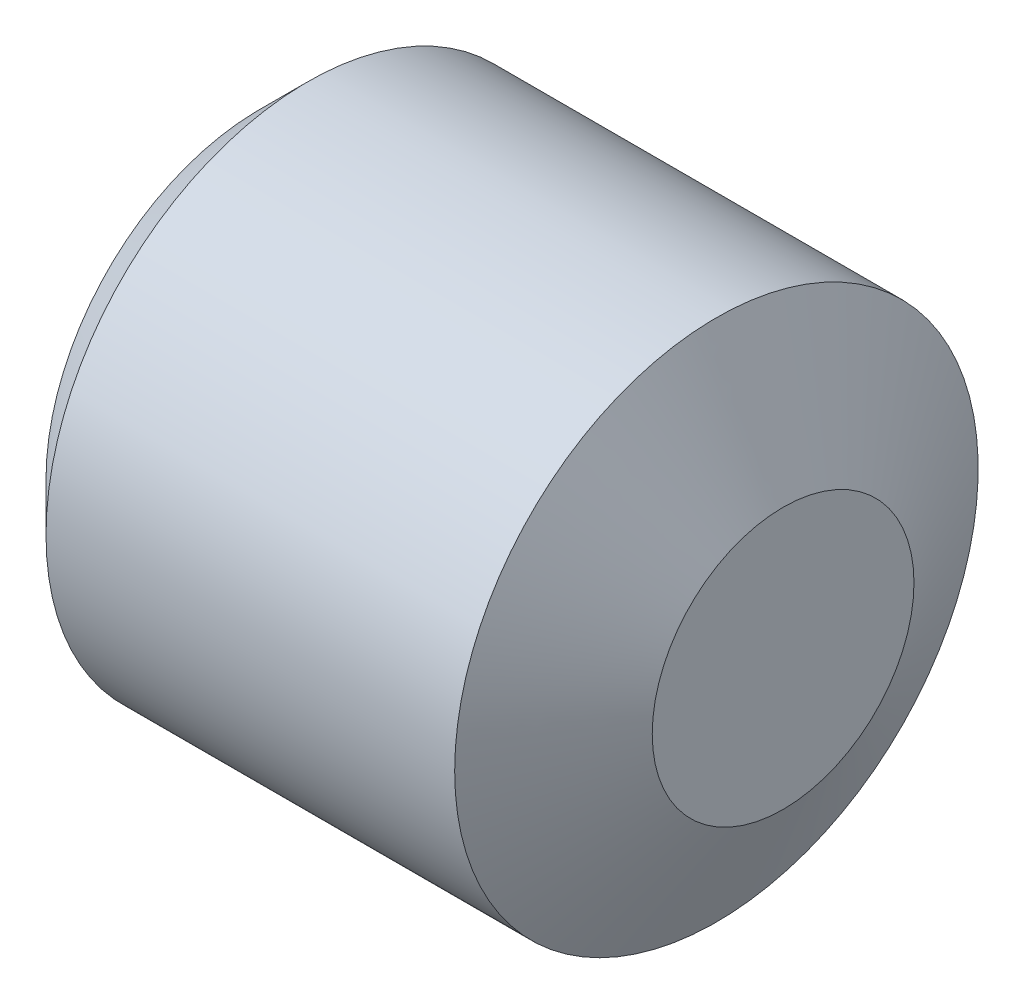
ISO-10303-21;
HEADER;
FILE_DESCRIPTION(('STEP AP214'),'2;1');
FILE_NAME('part.step','',(''),(''),'','','');
FILE_SCHEMA(('AUTOMOTIVE_DESIGN { 1 0 10303 214 1 1 1 1 }'));
ENDSEC;
DATA;
#1=APPLICATION_CONTEXT('core data for automotive mechanical design processes');
#2=APPLICATION_PROTOCOL_DEFINITION('international standard','automotive_design',2000,#1);
#3=PRODUCT_CONTEXT('',#1,'mechanical');
#4=PRODUCT('Part','Part','',(#3));
#5=PRODUCT_RELATED_PRODUCT_CATEGORY('part','',(#4));
#6=PRODUCT_DEFINITION_FORMATION('','',#4);
#7=PRODUCT_DEFINITION_CONTEXT('part definition',#1,'design');
#8=PRODUCT_DEFINITION('design','',#6,#7);
#9=PRODUCT_DEFINITION_SHAPE('','',#8);
#10=(LENGTH_UNIT() NAMED_UNIT(*) SI_UNIT(.MILLI.,.METRE.));
#11=(NAMED_UNIT(*) PLANE_ANGLE_UNIT() SI_UNIT($,.RADIAN.));
#12=(NAMED_UNIT(*) SI_UNIT($,.STERADIAN.) SOLID_ANGLE_UNIT());
#13=UNCERTAINTY_MEASURE_WITH_UNIT(LENGTH_MEASURE(1.E-05),#10,'distance_accuracy_value','');
#14=(GEOMETRIC_REPRESENTATION_CONTEXT(3) GLOBAL_UNCERTAINTY_ASSIGNED_CONTEXT((#13)) GLOBAL_UNIT_ASSIGNED_CONTEXT((#10,
#11,#12)) REPRESENTATION_CONTEXT('',''));
#15=CARTESIAN_POINT('',(0.,0.,0.));
#16=DIRECTION('',(0.,0.,1.));
#17=DIRECTION('',(1.,0.,0.));
#18=AXIS2_PLACEMENT_3D('',#15,#16,#17);
#19=CARTESIAN_POINT('',(10.,0.,1.25));
#20=DIRECTION('',(1.,0.,0.));
#21=DIRECTION('',(0.,0.,-1.));
#22=AXIS2_PLACEMENT_3D('',#19,#20,#21);
#23=PLANE('',#22);
#24=CARTESIAN_POINT('',(10.,0.,0.));
#25=DIRECTION('',(1.,0.,0.));
#26=DIRECTION('',(0.,0.,1.));
#27=AXIS2_PLACEMENT_3D('',#24,#25,#26);
#28=CIRCLE('',#27,2.5);
#29=CARTESIAN_POINT('',(10.,0.,2.5));
#30=VERTEX_POINT('',#29);
#31=EDGE_CURVE('E10',#30,#30,#28,.T.);
#32=ORIENTED_EDGE('',*,*,#31,.T.);
#33=EDGE_LOOP('',(#32));
#34=FACE_BOUND('',#33,.T.);
#35=ADVANCED_FACE('F15',(#34),#23,.T.);
#36=DIRECTION('',(0.453990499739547,0.,-0.891006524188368));
#37=VECTOR('',#36,1.);
#38=CARTESIAN_POINT('',(-254241.925484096,-1.22215714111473E-10,499000.));
#39=LINE('',#38,#37);
#40=CARTESIAN_POINT('',(11.2738136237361,0.,0.));
#41=DIRECTION('',(-1.,0.,0.));
#42=AXIS1_PLACEMENT('',#40,#41);
#43=SURFACE_OF_REVOLUTION('',#39,#42);
#44=CARTESIAN_POINT('',(8.72618637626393,0.,0.));
#45=DIRECTION('',(1.,0.,0.));
#46=DIRECTION('',(0.,0.,1.));
#47=AXIS2_PLACEMENT_3D('',#44,#45,#46);
#48=CIRCLE('',#47,5.);
#49=CARTESIAN_POINT('',(8.72618637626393,0.,5.));
#50=VERTEX_POINT('',#49);
#51=EDGE_CURVE('E25',#50,#50,#48,.T.);
#52=ORIENTED_EDGE('',*,*,#51,.T.);
#53=EDGE_LOOP('',(#52));
#54=FACE_BOUND('',#53,.T.);
#55=ORIENTED_EDGE('',*,*,#31,.F.);
#56=EDGE_LOOP('',(#55));
#57=FACE_BOUND('',#56,.T.);
#58=ADVANCED_FACE('F115',(#54,#57),#43,.F.);
#59=CARTESIAN_POINT('',(4.82309318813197,0.,0.));
#60=DIRECTION('',(1.,0.,0.));
#61=DIRECTION('',(0.,0.,-1.));
#62=AXIS2_PLACEMENT_3D('',#59,#60,#61);
#63=CYLINDRICAL_SURFACE('',#62,5.);
#64=CARTESIAN_POINT('',(0.920000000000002,0.,0.));
#65=DIRECTION('',(1.,0.,0.));
#66=DIRECTION('',(0.,0.,1.));
#67=AXIS2_PLACEMENT_3D('',#64,#65,#66);
#68=CIRCLE('',#67,5.);
#69=CARTESIAN_POINT('',(0.920000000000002,0.,5.));
#70=VERTEX_POINT('',#69);
#71=EDGE_CURVE('E216',#70,#70,#68,.T.);
#72=ORIENTED_EDGE('',*,*,#71,.T.);
#73=EDGE_LOOP('',(#72));
#74=FACE_BOUND('',#73,.T.);
#75=ORIENTED_EDGE('',*,*,#51,.F.);
#76=EDGE_LOOP('',(#75));
#77=FACE_BOUND('',#76,.T.);
#78=ADVANCED_FACE('F119',(#74,#77),#63,.T.);
#79=DIRECTION('',(-0.707106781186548,0.,-0.707106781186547));
#80=VECTOR('',#79,1.);
#81=CARTESIAN_POINT('',(498995.92,-1.22215714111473E-10,499000.));
#82=LINE('',#81,#80);
#83=CARTESIAN_POINT('',(-4.08,0.,0.));
#84=DIRECTION('',(1.,0.,0.));
#85=AXIS1_PLACEMENT('',#83,#84);
#86=SURFACE_OF_REVOLUTION('',#82,#85);
#87=CARTESIAN_POINT('',(0.,0.,0.));
#88=DIRECTION('',(1.,0.,0.));
#89=DIRECTION('',(0.,0.,1.));
#90=AXIS2_PLACEMENT_3D('',#87,#88,#89);
#91=CIRCLE('',#90,4.08);
#92=CARTESIAN_POINT('',(0.,0.,4.08));
#93=VERTEX_POINT('',#92);
#94=EDGE_CURVE('E215',#93,#93,#91,.T.);
#95=ORIENTED_EDGE('',*,*,#94,.T.);
#96=EDGE_LOOP('',(#95));
#97=FACE_BOUND('',#96,.T.);
#98=ORIENTED_EDGE('',*,*,#71,.F.);
#99=EDGE_LOOP('',(#98));
#100=FACE_BOUND('',#99,.T.);
#101=ADVANCED_FACE('F123',(#97,#100),#86,.F.);
#102=CARTESIAN_POINT('',(0.,0.,2.04));
#103=DIRECTION('',(-1.,0.,0.));
#104=DIRECTION('',(0.,0.,1.));
#105=AXIS2_PLACEMENT_3D('',#102,#103,#104);
#106=PLANE('',#105);
#107=ORIENTED_EDGE('',*,*,#94,.F.);
#108=EDGE_LOOP('',(#107));
#109=FACE_BOUND('',#108,.T.);
#110=DIRECTION('',(0.,-0.866025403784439,0.5));
#111=VECTOR('',#110,1.);
#112=CARTESIAN_POINT('',(0.,0.183327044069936,2.78090742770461));
#113=LINE('',#112,#111);
#114=CARTESIAN_POINT('',(0.,2.5,1.44337567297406));
#115=VERTEX_POINT('',#114);
#116=CARTESIAN_POINT('',(0.,0.,2.88675134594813));
#117=VERTEX_POINT('',#116);
#118=EDGE_CURVE('E105',#115,#117,#113,.T.);
#119=ORIENTED_EDGE('',*,*,#118,.T.);
#120=DIRECTION('',(0.,-0.866025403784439,-0.5));
#121=VECTOR('',#120,1.);
#122=CARTESIAN_POINT('',(0.,-1.43332704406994,2.05921959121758));
#123=LINE('',#122,#121);
#124=CARTESIAN_POINT('',(0.,-2.5,1.44337567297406));
#125=VERTEX_POINT('',#124);
#126=EDGE_CURVE('E103',#117,#125,#123,.T.);
#127=ORIENTED_EDGE('',*,*,#126,.T.);
#128=DIRECTION('',(0.,0.,-1.));
#129=VECTOR('',#128,1.);
#130=CARTESIAN_POINT('',(0.,-2.5,0.298312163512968));
#131=LINE('',#130,#129);
#132=CARTESIAN_POINT('',(0.,-2.5,-1.44337567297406));
#133=VERTEX_POINT('',#132);
#134=EDGE_CURVE('E88',#125,#133,#131,.T.);
#135=ORIENTED_EDGE('',*,*,#134,.T.);
#136=DIRECTION('',(0.,0.866025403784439,-0.5));
#137=VECTOR('',#136,1.);
#138=CARTESIAN_POINT('',(0.,-1.06667295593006,-2.27090742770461));
#139=LINE('',#138,#137);
#140=CARTESIAN_POINT('',(0.,0.,-2.88675134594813));
#141=VERTEX_POINT('',#140);
#142=EDGE_CURVE('E81',#133,#141,#139,.T.);
#143=ORIENTED_EDGE('',*,*,#142,.T.);
#144=DIRECTION('',(0.,0.866025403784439,0.5));
#145=VECTOR('',#144,1.);
#146=CARTESIAN_POINT('',(0.,2.31667295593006,-1.54921959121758));
#147=LINE('',#146,#145);
#148=CARTESIAN_POINT('',(0.,2.5,-1.44337567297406));
#149=VERTEX_POINT('',#148);
#150=EDGE_CURVE('E71',#141,#149,#147,.T.);
#151=ORIENTED_EDGE('',*,*,#150,.T.);
#152=DIRECTION('',(0.,0.,1.));
#153=VECTOR('',#152,1.);
#154=CARTESIAN_POINT('',(0.,2.5,1.74168783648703));
#155=LINE('',#154,#153);
#156=EDGE_CURVE('E82',#149,#115,#155,.T.);
#157=ORIENTED_EDGE('',*,*,#156,.T.);
#158=EDGE_LOOP('',(#119,#127,#135,#143,#151,#157));
#159=FACE_BOUND('',#158,.T.);
#160=ADVANCED_FACE('F86',(#109,#159),#106,.T.);
#161=CARTESIAN_POINT('',(6.,0.,0.));
#162=DIRECTION('',(-1.,0.,0.));
#163=DIRECTION('',(0.,0.,1.));
#164=AXIS2_PLACEMENT_3D('',#161,#162,#163);
#165=PLANE('',#164);
#166=DIRECTION('',(0.,0.866025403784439,-0.5));
#167=VECTOR('',#166,1.);
#168=CARTESIAN_POINT('',(6.,2.5,1.44337567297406));
#169=LINE('',#168,#167);
#170=CARTESIAN_POINT('',(6.,0.,2.88675134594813));
#171=VERTEX_POINT('',#170);
#172=CARTESIAN_POINT('',(6.,2.5,1.44337567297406));
#173=VERTEX_POINT('',#172);
#174=EDGE_CURVE('E106',#171,#173,#169,.T.);
#175=ORIENTED_EDGE('',*,*,#174,.T.);
#176=DIRECTION('',(0.,0.,-1.));
#177=VECTOR('',#176,1.);
#178=CARTESIAN_POINT('',(6.,2.5,-1.44337567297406));
#179=LINE('',#178,#177);
#180=CARTESIAN_POINT('',(6.,2.5,-1.44337567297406));
#181=VERTEX_POINT('',#180);
#182=EDGE_CURVE('E109',#173,#181,#179,.T.);
#183=ORIENTED_EDGE('',*,*,#182,.T.);
#184=DIRECTION('',(0.,-0.866025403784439,-0.5));
#185=VECTOR('',#184,1.);
#186=CARTESIAN_POINT('',(6.,0.,-2.88675134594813));
#187=LINE('',#186,#185);
#188=CARTESIAN_POINT('',(6.,0.,-2.88675134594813));
#189=VERTEX_POINT('',#188);
#190=EDGE_CURVE('E210',#181,#189,#187,.T.);
#191=ORIENTED_EDGE('',*,*,#190,.T.);
#192=DIRECTION('',(0.,-0.866025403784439,0.5));
#193=VECTOR('',#192,1.);
#194=CARTESIAN_POINT('',(6.,-2.5,-1.44337567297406));
#195=LINE('',#194,#193);
#196=CARTESIAN_POINT('',(6.,-2.5,-1.44337567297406));
#197=VERTEX_POINT('',#196);
#198=EDGE_CURVE('E94',#189,#197,#195,.T.);
#199=ORIENTED_EDGE('',*,*,#198,.T.);
#200=DIRECTION('',(0.,0.,1.));
#201=VECTOR('',#200,1.);
#202=CARTESIAN_POINT('',(6.,-2.5,1.44337567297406));
#203=LINE('',#202,#201);
#204=CARTESIAN_POINT('',(6.,-2.5,1.44337567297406));
#205=VERTEX_POINT('',#204);
#206=EDGE_CURVE('E110',#197,#205,#203,.T.);
#207=ORIENTED_EDGE('',*,*,#206,.T.);
#208=DIRECTION('',(0.,0.866025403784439,0.5));
#209=VECTOR('',#208,1.);
#210=CARTESIAN_POINT('',(6.,0.,2.88675134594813));
#211=LINE('',#210,#209);
#212=EDGE_CURVE('E112',#205,#171,#211,.T.);
#213=ORIENTED_EDGE('',*,*,#212,.T.);
#214=EDGE_LOOP('',(#175,#183,#191,#199,#207,#213));
#215=FACE_BOUND('',#214,.T.);
#216=ADVANCED_FACE('F130',(#215),#165,.T.);
#217=CARTESIAN_POINT('',(0.,-2.5,1.44337567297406));
#218=DIRECTION('',(0.,0.5,-0.866025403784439));
#219=DIRECTION('',(0.,0.866025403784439,0.5));
#220=AXIS2_PLACEMENT_3D('',#217,#218,#219);
#221=PLANE('',#220);
#222=ORIENTED_EDGE('',*,*,#212,.F.);
#223=DIRECTION('',(1.,0.,0.));
#224=VECTOR('',#223,1.);
#225=CARTESIAN_POINT('',(0.,-2.5,1.44337567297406));
#226=LINE('',#225,#224);
#227=EDGE_CURVE('E51',#125,#205,#226,.T.);
#228=ORIENTED_EDGE('',*,*,#227,.F.);
#229=ORIENTED_EDGE('',*,*,#126,.F.);
#230=DIRECTION('',(1.,0.,0.));
#231=VECTOR('',#230,1.);
#232=CARTESIAN_POINT('',(0.,0.,2.88675134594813));
#233=LINE('',#232,#231);
#234=EDGE_CURVE('E33',#117,#171,#233,.T.);
#235=ORIENTED_EDGE('',*,*,#234,.T.);
#236=EDGE_LOOP('',(#222,#228,#229,#235));
#237=FACE_BOUND('',#236,.T.);
#238=ADVANCED_FACE('F134',(#237),#221,.T.);
#239=CARTESIAN_POINT('',(0.,-2.5,-1.44337567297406));
#240=DIRECTION('',(0.,1.,0.));
#241=DIRECTION('',(0.,0.,1.));
#242=AXIS2_PLACEMENT_3D('',#239,#240,#241);
#243=PLANE('',#242);
#244=ORIENTED_EDGE('',*,*,#206,.F.);
#245=DIRECTION('',(1.,0.,0.));
#246=VECTOR('',#245,1.);
#247=CARTESIAN_POINT('',(0.,-2.5,-1.44337567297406));
#248=LINE('',#247,#246);
#249=EDGE_CURVE('E96',#133,#197,#248,.T.);
#250=ORIENTED_EDGE('',*,*,#249,.F.);
#251=ORIENTED_EDGE('',*,*,#134,.F.);
#252=ORIENTED_EDGE('',*,*,#227,.T.);
#253=EDGE_LOOP('',(#244,#250,#251,#252));
#254=FACE_BOUND('',#253,.T.);
#255=ADVANCED_FACE('F138',(#254),#243,.T.);
#256=CARTESIAN_POINT('',(0.,0.,-2.88675134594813));
#257=DIRECTION('',(0.,0.5,0.866025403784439));
#258=DIRECTION('',(0.,-0.866025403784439,0.5));
#259=AXIS2_PLACEMENT_3D('',#256,#257,#258);
#260=PLANE('',#259);
#261=ORIENTED_EDGE('',*,*,#198,.F.);
#262=DIRECTION('',(1.,0.,0.));
#263=VECTOR('',#262,1.);
#264=CARTESIAN_POINT('',(0.,0.,-2.88675134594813));
#265=LINE('',#264,#263);
#266=EDGE_CURVE('E76',#141,#189,#265,.T.);
#267=ORIENTED_EDGE('',*,*,#266,.F.);
#268=ORIENTED_EDGE('',*,*,#142,.F.);
#269=ORIENTED_EDGE('',*,*,#249,.T.);
#270=EDGE_LOOP('',(#261,#267,#268,#269));
#271=FACE_BOUND('',#270,.T.);
#272=ADVANCED_FACE('F92',(#271),#260,.T.);
#273=CARTESIAN_POINT('',(0.,2.5,-1.44337567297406));
#274=DIRECTION('',(0.,-0.5,0.866025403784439));
#275=DIRECTION('',(0.,-0.866025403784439,-0.5));
#276=AXIS2_PLACEMENT_3D('',#273,#274,#275);
#277=PLANE('',#276);
#278=ORIENTED_EDGE('',*,*,#190,.F.);
#279=DIRECTION('',(1.,0.,0.));
#280=VECTOR('',#279,1.);
#281=CARTESIAN_POINT('',(0.,2.5,-1.44337567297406));
#282=LINE('',#281,#280);
#283=EDGE_CURVE('E78',#149,#181,#282,.T.);
#284=ORIENTED_EDGE('',*,*,#283,.F.);
#285=ORIENTED_EDGE('',*,*,#150,.F.);
#286=ORIENTED_EDGE('',*,*,#266,.T.);
#287=EDGE_LOOP('',(#278,#284,#285,#286));
#288=FACE_BOUND('',#287,.T.);
#289=ADVANCED_FACE('F74',(#288),#277,.T.);
#290=CARTESIAN_POINT('',(0.,2.5,1.44337567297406));
#291=DIRECTION('',(0.,-1.,0.));
#292=DIRECTION('',(0.,0.,-1.));
#293=AXIS2_PLACEMENT_3D('',#290,#291,#292);
#294=PLANE('',#293);
#295=ORIENTED_EDGE('',*,*,#182,.F.);
#296=DIRECTION('',(1.,0.,0.));
#297=VECTOR('',#296,1.);
#298=CARTESIAN_POINT('',(0.,2.5,1.44337567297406));
#299=LINE('',#298,#297);
#300=EDGE_CURVE('E99',#115,#173,#299,.T.);
#301=ORIENTED_EDGE('',*,*,#300,.F.);
#302=ORIENTED_EDGE('',*,*,#156,.F.);
#303=ORIENTED_EDGE('',*,*,#283,.T.);
#304=EDGE_LOOP('',(#295,#301,#302,#303));
#305=FACE_BOUND('',#304,.T.);
#306=ADVANCED_FACE('F144',(#305),#294,.T.);
#307=CARTESIAN_POINT('',(0.,0.,2.88675134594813));
#308=DIRECTION('',(0.,-0.5,-0.866025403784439));
#309=DIRECTION('',(0.,0.866025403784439,-0.5));
#310=AXIS2_PLACEMENT_3D('',#307,#308,#309);
#311=PLANE('',#310);
#312=ORIENTED_EDGE('',*,*,#174,.F.);
#313=ORIENTED_EDGE('',*,*,#234,.F.);
#314=ORIENTED_EDGE('',*,*,#118,.F.);
#315=ORIENTED_EDGE('',*,*,#300,.T.);
#316=EDGE_LOOP('',(#312,#313,#314,#315));
#317=FACE_BOUND('',#316,.T.);
#318=ADVANCED_FACE('F17',(#317),#311,.T.);
#319=CLOSED_SHELL('',(#35,#58,#78,#101,#160,#216,#238,#255,#272,#289,#306,#318));
#320=MANIFOLD_SOLID_BREP('B1',#319);
#321=ADVANCED_BREP_SHAPE_REPRESENTATION('',(#18,#320),#14);
#322=SHAPE_DEFINITION_REPRESENTATION(#9,#321);
ENDSEC;
END-ISO-10303-21;
